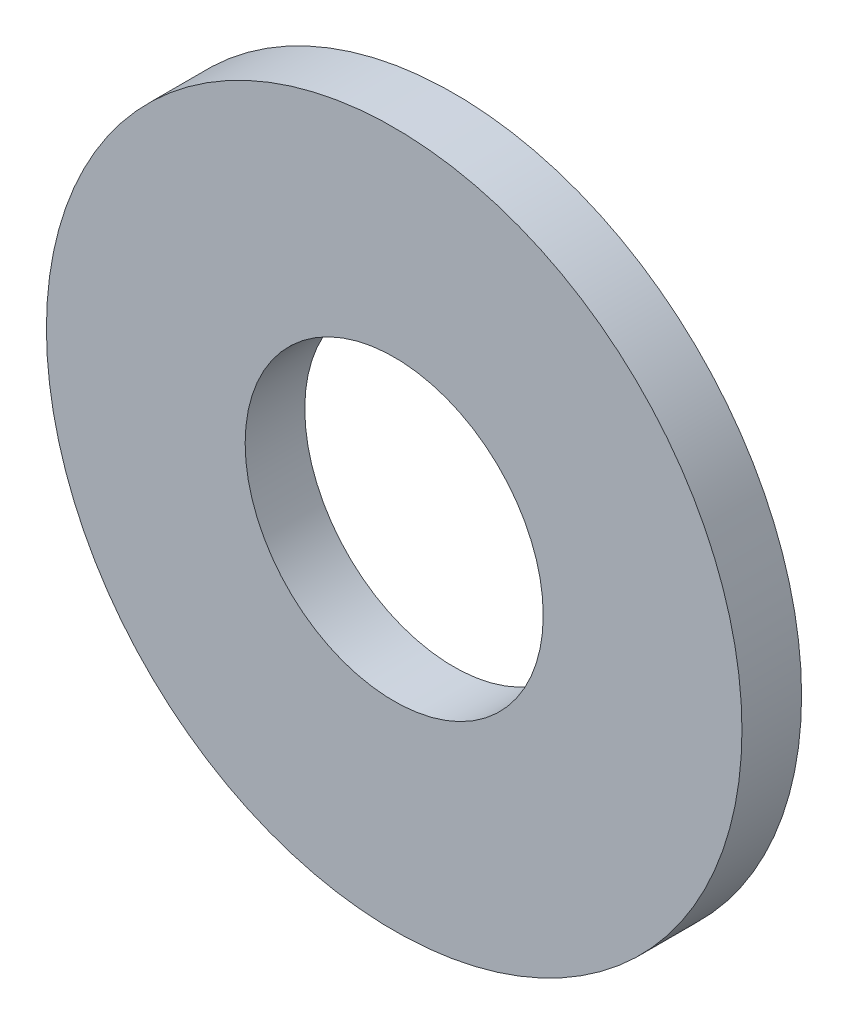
ISO-10303-21;
HEADER;
FILE_DESCRIPTION(('STEP AP214'),'2;1');
FILE_NAME('part.step','',(''),(''),'','','');
FILE_SCHEMA(('AUTOMOTIVE_DESIGN { 1 0 10303 214 1 1 1 1 }'));
ENDSEC;
DATA;
#1=APPLICATION_CONTEXT('core data for automotive mechanical design processes');
#2=APPLICATION_PROTOCOL_DEFINITION('international standard','automotive_design',2000,#1);
#3=PRODUCT_CONTEXT('',#1,'mechanical');
#4=PRODUCT('Part','Part','',(#3));
#5=PRODUCT_RELATED_PRODUCT_CATEGORY('part','',(#4));
#6=PRODUCT_DEFINITION_FORMATION('','',#4);
#7=PRODUCT_DEFINITION_CONTEXT('part definition',#1,'design');
#8=PRODUCT_DEFINITION('design','',#6,#7);
#9=PRODUCT_DEFINITION_SHAPE('','',#8);
#10=(LENGTH_UNIT() NAMED_UNIT(*) SI_UNIT(.MILLI.,.METRE.));
#11=(NAMED_UNIT(*) PLANE_ANGLE_UNIT() SI_UNIT($,.RADIAN.));
#12=(NAMED_UNIT(*) SI_UNIT($,.STERADIAN.) SOLID_ANGLE_UNIT());
#13=UNCERTAINTY_MEASURE_WITH_UNIT(LENGTH_MEASURE(1.E-05),#10,'distance_accuracy_value','');
#14=(GEOMETRIC_REPRESENTATION_CONTEXT(3) GLOBAL_UNCERTAINTY_ASSIGNED_CONTEXT((#13)) GLOBAL_UNIT_ASSIGNED_CONTEXT((#10,
#11,#12)) REPRESENTATION_CONTEXT('',''));
#15=CARTESIAN_POINT('',(0.,0.,0.));
#16=DIRECTION('',(0.,0.,1.));
#17=DIRECTION('',(1.,0.,0.));
#18=AXIS2_PLACEMENT_3D('',#15,#16,#17);
#19=CARTESIAN_POINT('',(0.,0.,0.6));
#20=DIRECTION('',(0.,0.,1.));
#21=DIRECTION('',(1.,0.,0.));
#22=AXIS2_PLACEMENT_3D('',#19,#20,#21);
#23=PLANE('',#22);
#24=CARTESIAN_POINT('',(0.,0.,0.6));
#25=DIRECTION('',(0.,0.,1.));
#26=DIRECTION('',(1.,0.,0.));
#27=AXIS2_PLACEMENT_3D('',#24,#25,#26);
#28=CIRCLE('',#27,3.5);
#29=CARTESIAN_POINT('',(3.5,0.,0.6));
#30=VERTEX_POINT('',#29);
#31=EDGE_CURVE('E10',#30,#30,#28,.T.);
#32=ORIENTED_EDGE('',*,*,#31,.T.);
#33=EDGE_LOOP('',(#32));
#34=FACE_BOUND('',#33,.T.);
#35=CARTESIAN_POINT('',(0.,0.,0.6));
#36=DIRECTION('',(0.,0.,1.));
#37=DIRECTION('',(1.,0.,0.));
#38=AXIS2_PLACEMENT_3D('',#35,#36,#37);
#39=CIRCLE('',#38,1.5);
#40=CARTESIAN_POINT('',(1.5,0.,0.6));
#41=VERTEX_POINT('',#40);
#42=EDGE_CURVE('E50',#41,#41,#39,.T.);
#43=ORIENTED_EDGE('',*,*,#42,.F.);
#44=EDGE_LOOP('',(#43));
#45=FACE_BOUND('',#44,.T.);
#46=ADVANCED_FACE('F39',(#34,#45),#23,.T.);
#47=CARTESIAN_POINT('',(0.,0.,0.));
#48=DIRECTION('',(0.,0.,1.));
#49=DIRECTION('',(1.,0.,0.));
#50=AXIS2_PLACEMENT_3D('',#47,#48,#49);
#51=PLANE('',#50);
#52=CARTESIAN_POINT('',(0.,0.,0.));
#53=DIRECTION('',(0.,0.,1.));
#54=DIRECTION('',(1.,0.,0.));
#55=AXIS2_PLACEMENT_3D('',#52,#53,#54);
#56=CIRCLE('',#55,3.5);
#57=CARTESIAN_POINT('',(3.5,0.,0.));
#58=VERTEX_POINT('',#57);
#59=EDGE_CURVE('E43',#58,#58,#56,.T.);
#60=ORIENTED_EDGE('',*,*,#59,.F.);
#61=EDGE_LOOP('',(#60));
#62=FACE_BOUND('',#61,.T.);
#63=CARTESIAN_POINT('',(0.,0.,0.));
#64=DIRECTION('',(0.,0.,1.));
#65=DIRECTION('',(1.,0.,0.));
#66=AXIS2_PLACEMENT_3D('',#63,#64,#65);
#67=CIRCLE('',#66,1.5);
#68=CARTESIAN_POINT('',(1.5,0.,0.));
#69=VERTEX_POINT('',#68);
#70=EDGE_CURVE('E52',#69,#69,#67,.T.);
#71=ORIENTED_EDGE('',*,*,#70,.T.);
#72=EDGE_LOOP('',(#71));
#73=FACE_BOUND('',#72,.T.);
#74=ADVANCED_FACE('F62',(#62,#73),#51,.F.);
#75=CARTESIAN_POINT('',(0.,0.,0.6));
#76=DIRECTION('',(0.,0.,-1.));
#77=DIRECTION('',(-1.,0.,0.));
#78=AXIS2_PLACEMENT_3D('',#75,#76,#77);
#79=CYLINDRICAL_SURFACE('',#78,3.5);
#80=ORIENTED_EDGE('',*,*,#31,.F.);
#81=EDGE_LOOP('',(#80));
#82=FACE_BOUND('',#81,.T.);
#83=ORIENTED_EDGE('',*,*,#59,.T.);
#84=EDGE_LOOP('',(#83));
#85=FACE_BOUND('',#84,.T.);
#86=ADVANCED_FACE('F41',(#82,#85),#79,.T.);
#87=CARTESIAN_POINT('',(0.,0.,0.6));
#88=DIRECTION('',(0.,0.,-1.));
#89=DIRECTION('',(-1.,0.,0.));
#90=AXIS2_PLACEMENT_3D('',#87,#88,#89);
#91=CYLINDRICAL_SURFACE('',#90,1.5);
#92=ORIENTED_EDGE('',*,*,#42,.T.);
#93=EDGE_LOOP('',(#92));
#94=FACE_BOUND('',#93,.T.);
#95=ORIENTED_EDGE('',*,*,#70,.F.);
#96=EDGE_LOOP('',(#95));
#97=FACE_BOUND('',#96,.T.);
#98=ADVANCED_FACE('F58',(#94,#97),#91,.F.);
#99=CLOSED_SHELL('',(#46,#74,#86,#98));
#100=MANIFOLD_SOLID_BREP('B2',#99);
#101=ADVANCED_BREP_SHAPE_REPRESENTATION('',(#18,#100),#14);
#102=SHAPE_DEFINITION_REPRESENTATION(#9,#101);
ENDSEC;
END-ISO-10303-21;
